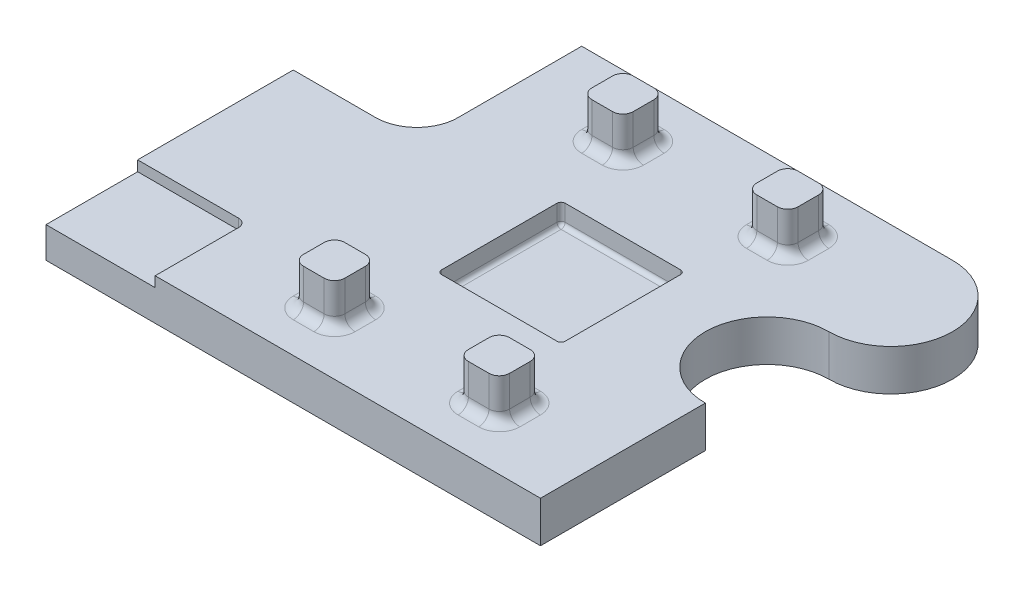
from build123d import *

# Parameters (mm, degrees)
EXTRUDE1_DEPTH          = 12.7
SKETCH2_W               = 12.7
SKETCH2_H               = 12.7
EXTRUDE2_DEPTH          = 12.7
FILLET2_R               = 3.175
SKETCH3_W               = 38.1
SKETCH3_H               = 38.1
CUT_EXTRUDE1_DEPTH      = 6.35
FILLET3_R               = 1.27
CUT_EXTRUDE3_DEPTH      = 116.178567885
CUT_EXTRUDE3_DEPTH_BACK = 116.178567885
CUT_EXTRUDE4_DEPTH      = 3.175


with BuildPart() as part:
    # Sketch1 → Extrude1 (new body)
    with BuildSketch(Plane(origin=(0, 0, 0), x_dir=(1, 0, 0), z_dir=(0, 1, 0))):
        with BuildLine():
            Line((-76.2, 63.5), (-76.2, -63.5))
            Line((-76.2, -63.5), (76.2, -63.5))
            Line((76.2, -63.5), (76.2, -12.7))
            ThreePointArc((76.2, -12.7), (57.15, 6.35), (76.2, 25.4))
            ThreePointArc((76.2, 25.4), (95.25, 44.45), (76.2, 63.5))
            Line((76.2, 63.5), (-76.2, 63.5))
        make_face()
    extrude(amount=EXTRUDE1_DEPTH)

    # Sketch2 → Extrude2 (add)
    with BuildSketch(Plane(origin=(0, 12.7, 0), x_dir=(-1, 0, 0), z_dir=(0, 1, 0))):
        with Locations((-44.45, -44.45)):
            Rectangle(SKETCH2_W, SKETCH2_H)
        with Locations((-44.45, 44.45)):
            Rectangle(SKETCH2_W, SKETCH2_H)
        with Locations((6.35, 44.45)):
            Rectangle(SKETCH2_W, SKETCH2_H)
        with Locations((6.35, -44.45)):
            Rectangle(SKETCH2_W, SKETCH2_H)
    extrude(amount=EXTRUDE2_DEPTH)

    # Fillet2
    fillet2_edges = [part.edges().sort_by_distance(p)[0] for p in [
        (38.1, 12.7, -44.45),
        (38.1, 19.05, -50.8),
        (44.45, 12.7, -38.1),
        (38.1, 19.05, -38.1),
        (50.8, 12.7, -44.45),
        (50.8, 19.05, -38.1),
        (44.45, 12.7, -50.8),
        (50.8, 19.05, -50.8),
        (38.1, 12.7, 44.45),
        (38.1, 19.05, 38.1),
        (44.45, 12.7, 50.8),
        (38.1, 19.05, 50.8),
        (50.8, 12.7, 44.45),
        (50.8, 19.05, 50.8),
        (44.45, 12.7, 38.1),
        (50.8, 19.05, 38.1),
        (0, 12.7, 44.45),
        (0, 19.05, 50.8),
        (-6.35, 12.7, 38.1),
        (0, 19.05, 38.1),
        (-12.7, 12.7, 44.45),
        (-12.7, 19.05, 38.1),
        (-6.35, 12.7, 50.8),
        (-12.7, 19.05, 50.8),
        (0, 12.7, -44.45),
        (0, 19.05, -38.1),
        (-6.35, 12.7, -50.8),
        (0, 19.05, -50.8),
        (-12.7, 12.7, -44.45),
        (-12.7, 19.05, -50.8),
        (-6.35, 12.7, -38.1),
        (-12.7, 19.05, -38.1),
    ]]
    fillet(fillet2_edges, radius=FILLET2_R)

    # Sketch3 → Cut-Extrude1 (cut)
    with BuildSketch(Plane(origin=(0, 12.7, 0), x_dir=(-1, 0, 0), z_dir=(0, 1, 0))):
        with Locations((-19.05, 0)):
            Rectangle(SKETCH3_W, SKETCH3_H)
    extrude(amount=-CUT_EXTRUDE1_DEPTH, mode=Mode.SUBTRACT)

    # Fillet3
    fillet3_edges = [part.edges().sort_by_distance(p)[0] for p in [
        (0, 6.35, 0),
        (0, 9.525, 19.05),
        (19.05, 6.35, -19.05),
        (0, 9.525, -19.05),
        (38.1, 6.35, 0),
        (38.1, 9.525, -19.05),
        (19.05, 6.35, 19.05),
        (38.1, 9.525, 19.05),
    ]]
    fillet(fillet3_edges, radius=FILLET3_R)

    # Sketch5 → Cut-Extrude3 (cut, two sides: drawn at the far end of the back side and taken through both)
    with BuildSketch(Plane(origin=(0, 12.7, 0), x_dir=(-1, 0, 0), z_dir=(0, 1, 0)).offset(-CUT_EXTRUDE3_DEPTH_BACK)):
        with BuildLine():
            Line((38.1, -448.741482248), (38.1, -63.5))
            Line((38.1, -63.5), (38.1, -25.4))
            ThreePointArc((38.1, -25.4), (41.819743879, -16.419743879), (50.8, -12.7))
            Line((50.8, -12.7), (76.2, -12.7))
            Line((76.2, -12.7), (461.441482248, -12.7))
            Line((461.441482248, -12.7), (1014.246132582, -549.403844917))
            Line((1014.246132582, -549.403844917), (590.904650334, -985.445327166))
            Line((590.904650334, -985.445327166), (38.1, -448.741482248))
        make_face()
    extrude(amount=CUT_EXTRUDE3_DEPTH + CUT_EXTRUDE3_DEPTH_BACK, mode=Mode.SUBTRACT)

    # Sketch6 → Cut-Extrude4 (cut)
    with BuildSketch(Plane(origin=(0, 12.7, 0), x_dir=(-1, 0, 0), z_dir=(0, 1, 0))):
        with BuildLine():
            Line((76.2, 35.260958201), (45.102653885, 35.260958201))
            ThreePointArc((45.102653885, 35.260958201), (43.306602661, 36.004906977), (42.562653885, 37.800958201))
            Line((42.562653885, 37.800958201), (42.562653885, 63.5))
            Line((42.562653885, 63.5), (76.2, 63.5))
            Line((76.2, 63.5), (76.2, 35.260958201))
        make_face()
    extrude(amount=-CUT_EXTRUDE4_DEPTH, mode=Mode.SUBTRACT)


solid = part.part
